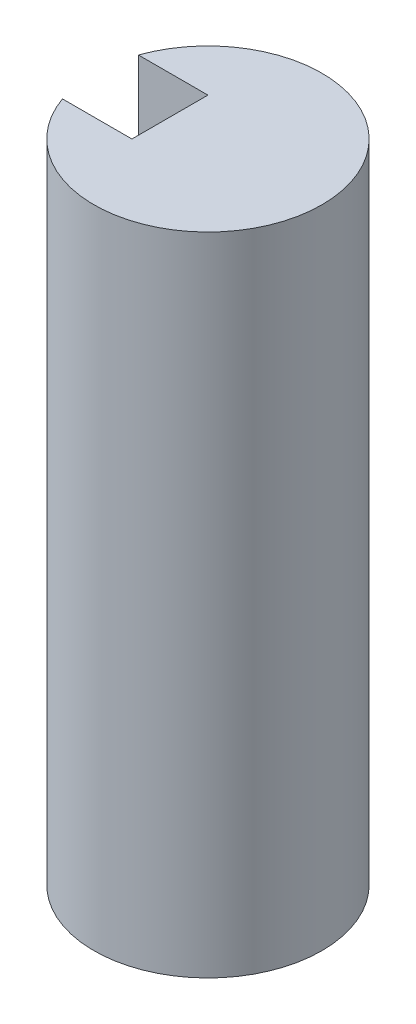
from build123d import *

# Parameters (mm, degrees)
BOSS_EXTRUDE2_DEPTH      = 4.5
BOSS_EXTRUDE2_DEPTH_BACK = 4
SKETCH3_R                = 1.5
SKETCH6_W                = 1
SKETCH6_H                = 1.5
CUT_EXTRUDE2_DEPTH       = 1


with BuildPart() as part:
    # Sketch3 → Boss-Extrude2 (new, two sides: drawn at the far end of the back side and taken through both)
    with BuildSketch(Plane(origin=(0, 0, 0), x_dir=(1, 0, 0), z_dir=(0, 1, 0)).offset(-BOSS_EXTRUDE2_DEPTH_BACK)):
        with Locations(Location((1.5, 0, 0), (0, 0, 270))):
            Circle(SKETCH3_R)
    extrude(amount=BOSS_EXTRUDE2_DEPTH + BOSS_EXTRUDE2_DEPTH_BACK)

    # Sketch6 → Cut-Extrude2 (cut)
    with BuildSketch(Plane(origin=(0, 0, 0), x_dir=(0, 0, -1), z_dir=(1, 0, 0))):
        with Locations((0, 3.75)):
            Rectangle(SKETCH6_W, SKETCH6_H)
        with Locations((0, -3.25)):
            Rectangle(SKETCH6_W, SKETCH6_H)
    extrude(amount=CUT_EXTRUDE2_DEPTH, mode=Mode.SUBTRACT)


solid = part.part
